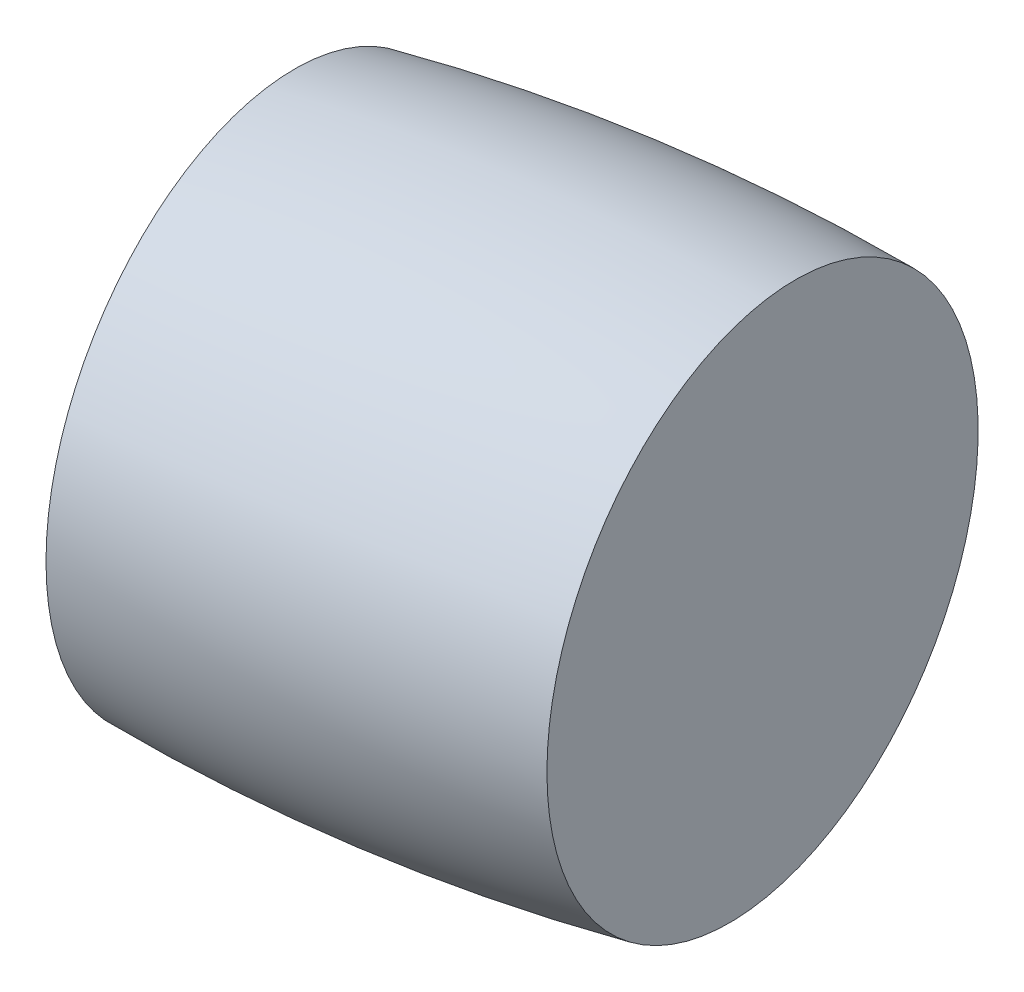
from build123d import *


with BuildPart() as part:
    # Esquisse1 → Base-R_volution (revolve)
    with BuildSketch(Plane(origin=(0, 0, 0), x_dir=(1, 0, 0), z_dir=(0, 1, 0)), mode=Mode.PRIVATE) as base_r_volution_sk:
        with BuildLine():
            Line((-8.433853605, -1.325200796), (-10, 8.642080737))
            ThreePointArc((-10, 8.642080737), (-1.641816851, 10.448864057), (6.86770721, 11.292482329))
            Line((6.86770721, 11.292482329), (8.433853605, 1.325200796))
            Line((8.433853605, 1.325200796), (-8.433853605, -1.325200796))
        make_face()
    revolve(base_r_volution_sk.sketch.rotate(Axis((-8.433853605, 0, 1.325200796), (0.9878792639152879, 0, -0.15522422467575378)), 180), axis=Axis((-8.433853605, 0, 1.325200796), (0.9878792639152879, 0, -0.15522422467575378)))


solid = part.part
